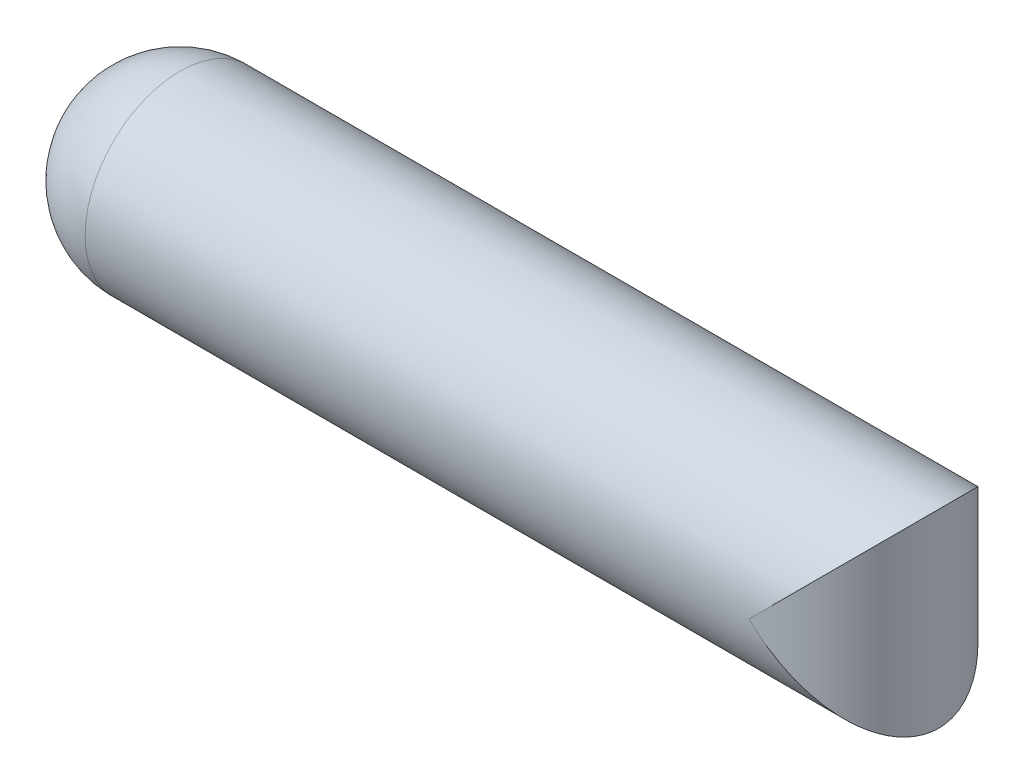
from build123d import *

# Parameters (mm, degrees)
SKETCH1_R               = 50.8
BOSS_EXTRUDE1_DEPTH     = 457.2
FILLET1_R               = 50.8
CUT_EXTRUDE1_DEPTH      = 463.810025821
CUT_EXTRUDE1_DEPTH_BACK = 463.810025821


with BuildPart() as part:
    # Sketch1 → Boss-Extrude1 (new body)
    with BuildSketch(Plane(origin=(0, 0, 0), x_dir=(0, 0, -1), z_dir=(1, 0, 0))):
        Circle(SKETCH1_R)
    extrude(amount=BOSS_EXTRUDE1_DEPTH)

    # Fillet1
    fillet1_edges = [part.edges().sort_by_distance(p)[0] for p in [
        (0, 0, 50.8),
    ]]
    fillet(fillet1_edges, radius=FILLET1_R)

    # Sketch2 → Cut-Extrude1 (cut, two sides: drawn at the far end of the back side and taken through both)
    with BuildSketch(Plane(origin=(0, 0, 0), x_dir=(1, 0, 0), z_dir=(0, 1, 0)).offset(-CUT_EXTRUDE1_DEPTH_BACK)):
        with BuildLine():
            Line((406.4, 50.8), (481.930256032, 50.8))
            Line((481.930256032, 50.8), (481.930256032, -50.8))
            Line((481.930256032, -50.8), (406.4, -50.8))
            ThreePointArc((406.4, -50.8), (457.2, 0), (406.4, 50.8))
        make_face()
    extrude(amount=CUT_EXTRUDE1_DEPTH + CUT_EXTRUDE1_DEPTH_BACK, mode=Mode.SUBTRACT)


solid = part.part
